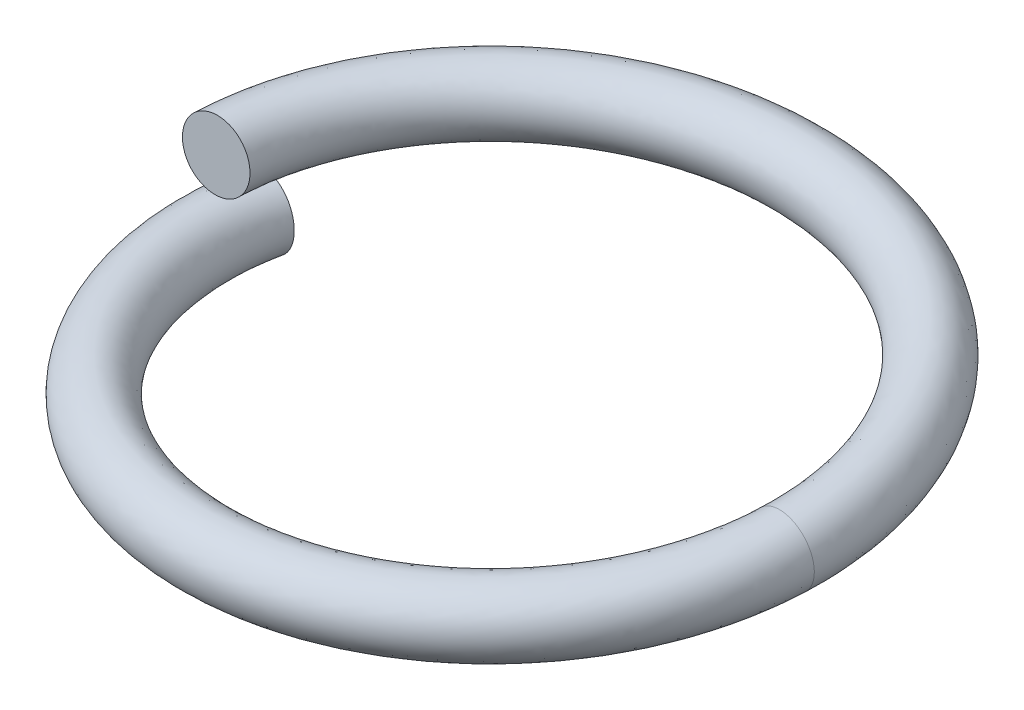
from build123d import *

# Parameters (mm, degrees)
SWEEP1_PITCH       = 1
SWEEP1_HEIGHT      = 1.025
SWEEP1_RADIUS      = 4.38
SWEEP1_START_ANGLE = -90
SWEEP1_PROFILE_R   = 0.5


with BuildPart() as part:
    # Sweep1: sweep along a helix
    with BuildLine() as sweep1_path:
        add(Helix(SWEEP1_PITCH, SWEEP1_HEIGHT, SWEEP1_RADIUS, center=(0, 0, 0), direction=(0, -1, 0), mode=Mode.PRIVATE).rotate(Axis((0, 0, 0), (0, -1, 0)), SWEEP1_START_ANGLE))
    # Sweep1 profile (on start of the path) → Sweep1 (sweep)
    with BuildSketch(Plane(origin=(-4.38, 0, 0), x_dir=(0, -0.9993404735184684, 0.03631277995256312), z_dir=(-9.047766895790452e-14, -0.03631277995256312, -0.9993404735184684))):
        Circle(SWEEP1_PROFILE_R)
    sweep(path=sweep1_path.line, is_frenet=True)


solid = part.part
